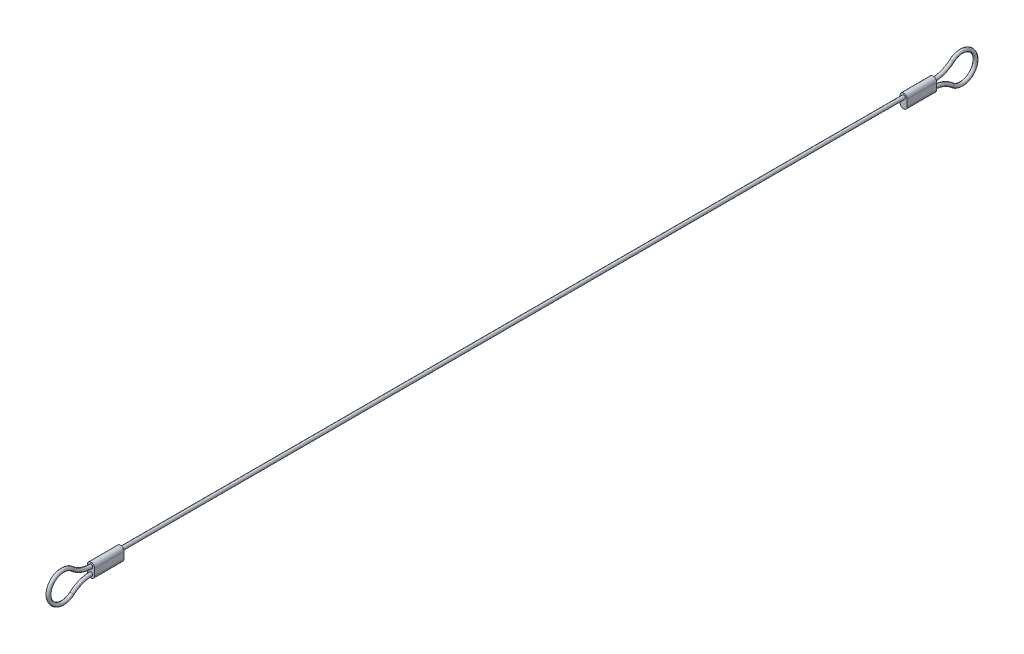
ISO-10303-21;
HEADER;
FILE_DESCRIPTION(('STEP AP214'),'2;1');
FILE_NAME('part.step','',(''),(''),'','','');
FILE_SCHEMA(('AUTOMOTIVE_DESIGN { 1 0 10303 214 1 1 1 1 }'));
ENDSEC;
DATA;
#1=APPLICATION_CONTEXT('core data for automotive mechanical design processes');
#2=APPLICATION_PROTOCOL_DEFINITION('international standard','automotive_design',2000,#1);
#3=PRODUCT_CONTEXT('',#1,'mechanical');
#4=PRODUCT('Part','Part','',(#3));
#5=PRODUCT_RELATED_PRODUCT_CATEGORY('part','',(#4));
#6=PRODUCT_DEFINITION_FORMATION('','',#4);
#7=PRODUCT_DEFINITION_CONTEXT('part definition',#1,'design');
#8=PRODUCT_DEFINITION('design','',#6,#7);
#9=PRODUCT_DEFINITION_SHAPE('','',#8);
#10=(LENGTH_UNIT() NAMED_UNIT(*) SI_UNIT(.MILLI.,.METRE.));
#11=(NAMED_UNIT(*) PLANE_ANGLE_UNIT() SI_UNIT($,.RADIAN.));
#12=(NAMED_UNIT(*) SI_UNIT($,.STERADIAN.) SOLID_ANGLE_UNIT());
#13=UNCERTAINTY_MEASURE_WITH_UNIT(LENGTH_MEASURE(1.E-05),#10,'distance_accuracy_value','');
#14=(GEOMETRIC_REPRESENTATION_CONTEXT(3) GLOBAL_UNCERTAINTY_ASSIGNED_CONTEXT((#13)) GLOBAL_UNIT_ASSIGNED_CONTEXT((#10,
#11,#12)) REPRESENTATION_CONTEXT('',''));
#15=CARTESIAN_POINT('',(0.,0.,0.));
#16=DIRECTION('',(0.,0.,1.));
#17=DIRECTION('',(1.,0.,0.));
#18=AXIS2_PLACEMENT_3D('',#15,#16,#17);
#19=CARTESIAN_POINT('',(0.,0.,-142.8));
#20=DIRECTION('',(0.,0.,1.));
#21=DIRECTION('',(1.,0.,0.));
#22=AXIS2_PLACEMENT_3D('',#19,#20,#21);
#23=CYLINDRICAL_SURFACE('',#22,0.595);
#24=CARTESIAN_POINT('',(0.,0.,-132.8));
#25=DIRECTION('',(0.,0.,1.));
#26=DIRECTION('',(0.,-1.,0.));
#27=AXIS2_PLACEMENT_3D('',#24,#25,#26);
#28=CIRCLE('',#27,0.595);
#29=CARTESIAN_POINT('',(0.,-0.595,-132.8));
#30=VERTEX_POINT('',#29);
#31=EDGE_CURVE('E11',#30,#30,#28,.F.);
#32=ORIENTED_EDGE('',*,*,#31,.F.);
#33=EDGE_LOOP('',(#32));
#34=FACE_BOUND('',#33,.T.);
#35=CARTESIAN_POINT('',(0.,0.,132.8));
#36=DIRECTION('',(0.,0.,-1.));
#37=DIRECTION('',(0.,1.,0.));
#38=AXIS2_PLACEMENT_3D('',#35,#36,#37);
#39=CIRCLE('',#38,0.595);
#40=CARTESIAN_POINT('',(0.,0.595,132.8));
#41=VERTEX_POINT('',#40);
#42=EDGE_CURVE('E51',#41,#41,#39,.F.);
#43=ORIENTED_EDGE('',*,*,#42,.F.);
#44=EDGE_LOOP('',(#43));
#45=FACE_BOUND('',#44,.T.);
#46=ADVANCED_FACE('F41',(#34,#45),#23,.T.);
#47=CARTESIAN_POINT('',(0.,2.0643209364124E-13,142.8));
#48=DIRECTION('',(0.,0.,-1.));
#49=DIRECTION('',(0.,1.,0.));
#50=AXIS2_PLACEMENT_3D('',#47,#48,#49);
#51=PLANE('',#50);
#52=CARTESIAN_POINT('',(0.,2.0643209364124E-13,142.8));
#53=DIRECTION('',(0.,0.,-1.));
#54=DIRECTION('',(0.,1.,0.));
#55=AXIS2_PLACEMENT_3D('',#52,#53,#54);
#56=CIRCLE('',#55,1.2);
#57=CARTESIAN_POINT('',(-1.2,2.06579051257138E-13,142.8));
#58=VERTEX_POINT('',#57);
#59=CARTESIAN_POINT('',(1.2,2.06285136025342E-13,142.8));
#60=VERTEX_POINT('',#59);
#61=EDGE_CURVE('E186',#58,#60,#56,.T.);
#62=ORIENTED_EDGE('',*,*,#61,.F.);
#63=DIRECTION('',(0.,1.,0.));
#64=VECTOR('',#63,1.);
#65=CARTESIAN_POINT('',(-1.2,2.06579051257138E-13,142.8));
#66=LINE('',#65,#64);
#67=CARTESIAN_POINT('',(-1.2,-2.26625258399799,142.8));
#68=VERTEX_POINT('',#67);
#69=EDGE_CURVE('E83',#68,#58,#66,.T.);
#70=ORIENTED_EDGE('',*,*,#69,.F.);
#71=CARTESIAN_POINT('',(0.,-2.26625258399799,142.8));
#72=DIRECTION('',(0.,0.,-1.));
#73=DIRECTION('',(0.,1.,0.));
#74=AXIS2_PLACEMENT_3D('',#71,#72,#73);
#75=CIRCLE('',#74,1.2);
#76=CARTESIAN_POINT('',(1.2,-2.26625258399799,142.8));
#77=VERTEX_POINT('',#76);
#78=EDGE_CURVE('E77',#77,#68,#75,.T.);
#79=ORIENTED_EDGE('',*,*,#78,.F.);
#80=DIRECTION('',(0.,-1.,0.));
#81=VECTOR('',#80,1.);
#82=CARTESIAN_POINT('',(1.2,2.06285136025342E-13,142.8));
#83=LINE('',#82,#81);
#84=EDGE_CURVE('E190',#60,#77,#83,.T.);
#85=ORIENTED_EDGE('',*,*,#84,.F.);
#86=EDGE_LOOP('',(#62,#70,#79,#85));
#87=FACE_BOUND('',#86,.T.);
#88=CARTESIAN_POINT('',(0.,0.,142.8));
#89=DIRECTION('',(0.,0.,-1.));
#90=DIRECTION('',(0.,1.,0.));
#91=AXIS2_PLACEMENT_3D('',#88,#89,#90);
#92=CIRCLE('',#91,0.595);
#93=CARTESIAN_POINT('',(0.,-0.594999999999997,142.8));
#94=VERTEX_POINT('',#93);
#95=EDGE_CURVE('E207',#94,#94,#92,.F.);
#96=ORIENTED_EDGE('',*,*,#95,.F.);
#97=EDGE_LOOP('',(#96));
#98=FACE_BOUND('',#97,.T.);
#99=CARTESIAN_POINT('',(0.,-2.26625258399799,142.8));
#100=DIRECTION('',(0.,0.,-1.));
#101=DIRECTION('',(1.,0.,0.));
#102=AXIS2_PLACEMENT_3D('',#99,#100,#101);
#103=CIRCLE('',#102,0.595);
#104=CARTESIAN_POINT('',(0.,-1.67125258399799,142.8));
#105=VERTEX_POINT('',#104);
#106=EDGE_CURVE('E233',#105,#105,#103,.T.);
#107=ORIENTED_EDGE('',*,*,#106,.T.);
#108=EDGE_LOOP('',(#107));
#109=FACE_BOUND('',#108,.T.);
#110=ADVANCED_FACE('F243',(#87,#98,#109),#51,.F.);
#111=CARTESIAN_POINT('',(0.,1.91976064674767E-13,132.8));
#112=DIRECTION('',(0.,0.,1.));
#113=DIRECTION('',(0.,-1.,0.));
#114=AXIS2_PLACEMENT_3D('',#111,#112,#113);
#115=CYLINDRICAL_SURFACE('',#114,1.2);
#116=ORIENTED_EDGE('',*,*,#61,.T.);
#117=DIRECTION('',(0.,0.,1.));
#118=VECTOR('',#117,1.);
#119=CARTESIAN_POINT('',(1.2,1.91829107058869E-13,132.8));
#120=LINE('',#119,#118);
#121=CARTESIAN_POINT('',(1.2,1.91829107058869E-13,132.8));
#122=VERTEX_POINT('',#121);
#123=EDGE_CURVE('E204',#122,#60,#120,.T.);
#124=ORIENTED_EDGE('',*,*,#123,.F.);
#125=CARTESIAN_POINT('',(0.,1.91976064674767E-13,132.8));
#126=DIRECTION('',(0.,0.,-1.));
#127=DIRECTION('',(0.,1.,0.));
#128=AXIS2_PLACEMENT_3D('',#125,#126,#127);
#129=CIRCLE('',#128,1.2);
#130=CARTESIAN_POINT('',(-1.2,1.92123022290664E-13,132.8));
#131=VERTEX_POINT('',#130);
#132=EDGE_CURVE('E175',#131,#122,#129,.T.);
#133=ORIENTED_EDGE('',*,*,#132,.F.);
#134=DIRECTION('',(0.,0.,1.));
#135=VECTOR('',#134,1.);
#136=CARTESIAN_POINT('',(-1.2,1.92123022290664E-13,132.8));
#137=LINE('',#136,#135);
#138=EDGE_CURVE('E185',#131,#58,#137,.T.);
#139=ORIENTED_EDGE('',*,*,#138,.T.);
#140=EDGE_LOOP('',(#116,#124,#133,#139));
#141=FACE_BOUND('',#140,.T.);
#142=ADVANCED_FACE('F249',(#141),#115,.T.);
#143=CARTESIAN_POINT('',(1.2,1.91829107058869E-13,132.8));
#144=DIRECTION('',(-1.,0.,0.));
#145=DIRECTION('',(0.,0.,1.));
#146=AXIS2_PLACEMENT_3D('',#143,#144,#145);
#147=PLANE('',#146);
#148=ORIENTED_EDGE('',*,*,#84,.T.);
#149=DIRECTION('',(0.,0.,1.));
#150=VECTOR('',#149,1.);
#151=CARTESIAN_POINT('',(1.2,-2.266252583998,132.8));
#152=LINE('',#151,#150);
#153=CARTESIAN_POINT('',(1.2,-2.266252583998,132.8));
#154=VERTEX_POINT('',#153);
#155=EDGE_CURVE('E201',#154,#77,#152,.T.);
#156=ORIENTED_EDGE('',*,*,#155,.F.);
#157=DIRECTION('',(0.,-1.,0.));
#158=VECTOR('',#157,1.);
#159=CARTESIAN_POINT('',(1.2,1.91829107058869E-13,132.8));
#160=LINE('',#159,#158);
#161=EDGE_CURVE('E91',#122,#154,#160,.T.);
#162=ORIENTED_EDGE('',*,*,#161,.F.);
#163=ORIENTED_EDGE('',*,*,#123,.T.);
#164=EDGE_LOOP('',(#148,#156,#162,#163));
#165=FACE_BOUND('',#164,.T.);
#166=ADVANCED_FACE('F291',(#165),#147,.F.);
#167=CARTESIAN_POINT('',(0.,-2.266252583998,132.8));
#168=DIRECTION('',(0.,0.,1.));
#169=DIRECTION('',(0.,-1.,0.));
#170=AXIS2_PLACEMENT_3D('',#167,#168,#169);
#171=CYLINDRICAL_SURFACE('',#170,1.2);
#172=ORIENTED_EDGE('',*,*,#78,.T.);
#173=DIRECTION('',(0.,0.,1.));
#174=VECTOR('',#173,1.);
#175=CARTESIAN_POINT('',(-1.2,-2.266252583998,132.8));
#176=LINE('',#175,#174);
#177=CARTESIAN_POINT('',(-1.2,-2.266252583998,132.8));
#178=VERTEX_POINT('',#177);
#179=EDGE_CURVE('E198',#178,#68,#176,.T.);
#180=ORIENTED_EDGE('',*,*,#179,.F.);
#181=CARTESIAN_POINT('',(0.,-2.266252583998,132.8));
#182=DIRECTION('',(0.,0.,-1.));
#183=DIRECTION('',(0.,1.,0.));
#184=AXIS2_PLACEMENT_3D('',#181,#182,#183);
#185=CIRCLE('',#184,1.2);
#186=EDGE_CURVE('E180',#154,#178,#185,.T.);
#187=ORIENTED_EDGE('',*,*,#186,.F.);
#188=ORIENTED_EDGE('',*,*,#155,.T.);
#189=EDGE_LOOP('',(#172,#180,#187,#188));
#190=FACE_BOUND('',#189,.T.);
#191=ADVANCED_FACE('F284',(#190),#171,.T.);
#192=CARTESIAN_POINT('',(-1.2,1.92123022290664E-13,132.8));
#193=DIRECTION('',(1.,0.,0.));
#194=DIRECTION('',(0.,1.,0.));
#195=AXIS2_PLACEMENT_3D('',#192,#193,#194);
#196=PLANE('',#195);
#197=ORIENTED_EDGE('',*,*,#69,.T.);
#198=ORIENTED_EDGE('',*,*,#138,.F.);
#199=DIRECTION('',(0.,1.,0.));
#200=VECTOR('',#199,1.);
#201=CARTESIAN_POINT('',(-1.2,1.92123022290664E-13,132.8));
#202=LINE('',#201,#200);
#203=EDGE_CURVE('E59',#178,#131,#202,.T.);
#204=ORIENTED_EDGE('',*,*,#203,.F.);
#205=ORIENTED_EDGE('',*,*,#179,.T.);
#206=EDGE_LOOP('',(#197,#198,#204,#205));
#207=FACE_BOUND('',#206,.T.);
#208=ADVANCED_FACE('F279',(#207),#196,.F.);
#209=CARTESIAN_POINT('',(0.,1.91976064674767E-13,132.8));
#210=DIRECTION('',(0.,0.,-1.));
#211=DIRECTION('',(0.,1.,0.));
#212=AXIS2_PLACEMENT_3D('',#209,#210,#211);
#213=PLANE('',#212);
#214=ORIENTED_EDGE('',*,*,#42,.T.);
#215=EDGE_LOOP('',(#214));
#216=FACE_BOUND('',#215,.T.);
#217=ORIENTED_EDGE('',*,*,#132,.T.);
#218=ORIENTED_EDGE('',*,*,#161,.T.);
#219=ORIENTED_EDGE('',*,*,#186,.T.);
#220=ORIENTED_EDGE('',*,*,#203,.T.);
#221=EDGE_LOOP('',(#217,#218,#219,#220));
#222=FACE_BOUND('',#221,.T.);
#223=ADVANCED_FACE('F240',(#216,#222),#213,.T.);
#224=CARTESIAN_POINT('',(0.,-11.866252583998,142.8));
#225=DIRECTION('',(-1.,0.,0.));
#226=DIRECTION('',(0.,0.,1.));
#227=AXIS2_PLACEMENT_3D('',#224,#225,#226);
#228=TOROIDAL_SURFACE('',#227,9.59999999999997,0.595);
#229=CARTESIAN_POINT('',(0.,-4.71083505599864,149.2));
#230=DIRECTION('',(0.,0.666666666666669,-0.745355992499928));
#231=DIRECTION('',(1.,0.,0.));
#232=AXIS2_PLACEMENT_3D('',#229,#230,#231);
#233=CIRCLE('',#232,0.595);
#234=CARTESIAN_POINT('',(0.,-4.26734824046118,149.596666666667));
#235=VERTEX_POINT('',#234);
#236=EDGE_CURVE('E229',#235,#235,#233,.T.);
#237=CARTESIAN_POINT('',(0.,-11.866252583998,142.8));
#238=DIRECTION('',(-1.,0.,0.));
#239=DIRECTION('',(0.,0.,1.));
#240=AXIS2_PLACEMENT_3D('',#237,#238,#239);
#241=CIRCLE('',#240,10.195);
#242=EDGE_CURVE('',#235,#105,#241,.T.);
#243=ORIENTED_EDGE('',*,*,#236,.T.);
#244=ORIENTED_EDGE('',*,*,#106,.F.);
#245=ORIENTED_EDGE('',*,*,#242,.T.);
#246=ORIENTED_EDGE('',*,*,#242,.F.);
#247=EDGE_LOOP('',(#243,#245,#244,#246));
#248=FACE_BOUND('',#247,.T.);
#249=ADVANCED_FACE('F43',(#248),#228,.T.);
#250=CARTESIAN_POINT('',(0.,-1.13312629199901,152.4));
#251=DIRECTION('',(1.,0.,0.));
#252=DIRECTION('',(0.,0.,-1.));
#253=AXIS2_PLACEMENT_3D('',#250,#251,#252);
#254=TOROIDAL_SURFACE('',#253,4.80000000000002,0.595);
#255=ORIENTED_EDGE('',*,*,#236,.F.);
#256=EDGE_LOOP('',(#255));
#257=FACE_BOUND('',#256,.T.);
#258=CARTESIAN_POINT('',(0.,2.4445824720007,149.2));
#259=DIRECTION('',(0.,0.666666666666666,0.745355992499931));
#260=DIRECTION('',(1.,0.,0.));
#261=AXIS2_PLACEMENT_3D('',#258,#259,#260);
#262=CIRCLE('',#261,0.595);
#263=CARTESIAN_POINT('',(0.,2.00109565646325,149.596666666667));
#264=VERTEX_POINT('',#263);
#265=EDGE_CURVE('E225',#264,#264,#262,.T.);
#266=ORIENTED_EDGE('',*,*,#265,.T.);
#267=EDGE_LOOP('',(#266));
#268=FACE_BOUND('',#267,.T.);
#269=ADVANCED_FACE('F259',(#257,#268),#254,.T.);
#270=CARTESIAN_POINT('',(0.,9.59999999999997,142.8));
#271=DIRECTION('',(-1.,0.,0.));
#272=DIRECTION('',(0.,0.,1.));
#273=AXIS2_PLACEMENT_3D('',#270,#271,#272);
#274=TOROIDAL_SURFACE('',#273,9.59999999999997,0.595);
#275=CARTESIAN_POINT('',(0.,9.59999999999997,142.8));
#276=DIRECTION('',(-1.,0.,0.));
#277=DIRECTION('',(0.,0.,1.));
#278=AXIS2_PLACEMENT_3D('',#275,#276,#277);
#279=CIRCLE('',#278,10.195);
#280=EDGE_CURVE('',#94,#264,#279,.T.);
#281=ORIENTED_EDGE('',*,*,#95,.T.);
#282=ORIENTED_EDGE('',*,*,#265,.F.);
#283=ORIENTED_EDGE('',*,*,#280,.T.);
#284=ORIENTED_EDGE('',*,*,#280,.F.);
#285=EDGE_LOOP('',(#281,#283,#282,#284));
#286=FACE_BOUND('',#285,.T.);
#287=ADVANCED_FACE('F257',(#286),#274,.T.);
#288=CARTESIAN_POINT('',(0.,1.91976064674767E-13,-132.8));
#289=DIRECTION('',(0.,0.,-1.));
#290=DIRECTION('',(0.,1.,0.));
#291=AXIS2_PLACEMENT_3D('',#288,#289,#290);
#292=CYLINDRICAL_SURFACE('',#291,1.2);
#293=CARTESIAN_POINT('',(0.,2.0643209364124E-13,-142.8));
#294=DIRECTION('',(0.,0.,-1.));
#295=DIRECTION('',(0.,1.,0.));
#296=AXIS2_PLACEMENT_3D('',#293,#294,#295);
#297=CIRCLE('',#296,1.2);
#298=CARTESIAN_POINT('',(-1.2,2.06579051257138E-13,-142.8));
#299=VERTEX_POINT('',#298);
#300=CARTESIAN_POINT('',(1.2,2.06285136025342E-13,-142.8));
#301=VERTEX_POINT('',#300);
#302=EDGE_CURVE('E124',#299,#301,#297,.T.);
#303=ORIENTED_EDGE('',*,*,#302,.F.);
#304=DIRECTION('',(0.,0.,-1.));
#305=VECTOR('',#304,1.);
#306=CARTESIAN_POINT('',(-1.2,1.92123022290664E-13,-132.8));
#307=LINE('',#306,#305);
#308=CARTESIAN_POINT('',(-1.2,1.92123022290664E-13,-132.8));
#309=VERTEX_POINT('',#308);
#310=EDGE_CURVE('E118',#309,#299,#307,.T.);
#311=ORIENTED_EDGE('',*,*,#310,.F.);
#312=CARTESIAN_POINT('',(0.,1.91976064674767E-13,-132.8));
#313=DIRECTION('',(0.,0.,-1.));
#314=DIRECTION('',(0.,1.,0.));
#315=AXIS2_PLACEMENT_3D('',#312,#313,#314);
#316=CIRCLE('',#315,1.2);
#317=CARTESIAN_POINT('',(1.2,1.91829107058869E-13,-132.8));
#318=VERTEX_POINT('',#317);
#319=EDGE_CURVE('E121',#309,#318,#316,.T.);
#320=ORIENTED_EDGE('',*,*,#319,.T.);
#321=DIRECTION('',(0.,0.,-1.));
#322=VECTOR('',#321,1.);
#323=CARTESIAN_POINT('',(1.2,1.91829107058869E-13,-132.8));
#324=LINE('',#323,#322);
#325=EDGE_CURVE('E155',#318,#301,#324,.T.);
#326=ORIENTED_EDGE('',*,*,#325,.T.);
#327=EDGE_LOOP('',(#303,#311,#320,#326));
#328=FACE_BOUND('',#327,.T.);
#329=ADVANCED_FACE('F120',(#328),#292,.T.);
#330=CARTESIAN_POINT('',(-1.2,1.92123022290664E-13,-132.8));
#331=DIRECTION('',(-1.,0.,0.));
#332=DIRECTION('',(0.,-1.,0.));
#333=AXIS2_PLACEMENT_3D('',#330,#331,#332);
#334=PLANE('',#333);
#335=DIRECTION('',(0.,1.,0.));
#336=VECTOR('',#335,1.);
#337=CARTESIAN_POINT('',(-1.2,2.06579051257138E-13,-142.8));
#338=LINE('',#337,#336);
#339=CARTESIAN_POINT('',(-1.2,-2.26625258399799,-142.8));
#340=VERTEX_POINT('',#339);
#341=EDGE_CURVE('E158',#340,#299,#338,.T.);
#342=ORIENTED_EDGE('',*,*,#341,.F.);
#343=DIRECTION('',(0.,0.,-1.));
#344=VECTOR('',#343,1.);
#345=CARTESIAN_POINT('',(-1.2,-2.266252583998,-132.8));
#346=LINE('',#345,#344);
#347=CARTESIAN_POINT('',(-1.2,-2.266252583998,-132.8));
#348=VERTEX_POINT('',#347);
#349=EDGE_CURVE('E131',#348,#340,#346,.T.);
#350=ORIENTED_EDGE('',*,*,#349,.F.);
#351=DIRECTION('',(0.,1.,0.));
#352=VECTOR('',#351,1.);
#353=CARTESIAN_POINT('',(-1.2,1.92123022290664E-13,-132.8));
#354=LINE('',#353,#352);
#355=EDGE_CURVE('E137',#348,#309,#354,.T.);
#356=ORIENTED_EDGE('',*,*,#355,.T.);
#357=ORIENTED_EDGE('',*,*,#310,.T.);
#358=EDGE_LOOP('',(#342,#350,#356,#357));
#359=FACE_BOUND('',#358,.T.);
#360=ADVANCED_FACE('F144',(#359),#334,.T.);
#361=CARTESIAN_POINT('',(0.,-2.266252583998,-132.8));
#362=DIRECTION('',(0.,0.,-1.));
#363=DIRECTION('',(0.,1.,0.));
#364=AXIS2_PLACEMENT_3D('',#361,#362,#363);
#365=CYLINDRICAL_SURFACE('',#364,1.2);
#366=CARTESIAN_POINT('',(0.,-2.26625258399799,-142.8));
#367=DIRECTION('',(0.,0.,-1.));
#368=DIRECTION('',(0.,1.,0.));
#369=AXIS2_PLACEMENT_3D('',#366,#367,#368);
#370=CIRCLE('',#369,1.2);
#371=CARTESIAN_POINT('',(1.2,-2.26625258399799,-142.8));
#372=VERTEX_POINT('',#371);
#373=EDGE_CURVE('E161',#372,#340,#370,.T.);
#374=ORIENTED_EDGE('',*,*,#373,.F.);
#375=DIRECTION('',(0.,0.,-1.));
#376=VECTOR('',#375,1.);
#377=CARTESIAN_POINT('',(1.2,-2.266252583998,-132.8));
#378=LINE('',#377,#376);
#379=CARTESIAN_POINT('',(1.2,-2.266252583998,-132.8));
#380=VERTEX_POINT('',#379);
#381=EDGE_CURVE('E170',#380,#372,#378,.T.);
#382=ORIENTED_EDGE('',*,*,#381,.F.);
#383=CARTESIAN_POINT('',(0.,-2.266252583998,-132.8));
#384=DIRECTION('',(0.,0.,-1.));
#385=DIRECTION('',(0.,1.,0.));
#386=AXIS2_PLACEMENT_3D('',#383,#384,#385);
#387=CIRCLE('',#386,1.2);
#388=EDGE_CURVE('E146',#380,#348,#387,.T.);
#389=ORIENTED_EDGE('',*,*,#388,.T.);
#390=ORIENTED_EDGE('',*,*,#349,.T.);
#391=EDGE_LOOP('',(#374,#382,#389,#390));
#392=FACE_BOUND('',#391,.T.);
#393=ADVANCED_FACE('F324',(#392),#365,.T.);
#394=CARTESIAN_POINT('',(1.2,1.91829107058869E-13,-132.8));
#395=DIRECTION('',(1.,0.,0.));
#396=DIRECTION('',(0.,0.,-1.));
#397=AXIS2_PLACEMENT_3D('',#394,#395,#396);
#398=PLANE('',#397);
#399=DIRECTION('',(0.,-1.,0.));
#400=VECTOR('',#399,1.);
#401=CARTESIAN_POINT('',(1.2,2.06285136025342E-13,-142.8));
#402=LINE('',#401,#400);
#403=EDGE_CURVE('E142',#301,#372,#402,.T.);
#404=ORIENTED_EDGE('',*,*,#403,.F.);
#405=ORIENTED_EDGE('',*,*,#325,.F.);
#406=DIRECTION('',(0.,-1.,0.));
#407=VECTOR('',#406,1.);
#408=CARTESIAN_POINT('',(1.2,1.91829107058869E-13,-132.8));
#409=LINE('',#408,#407);
#410=EDGE_CURVE('E140',#318,#380,#409,.T.);
#411=ORIENTED_EDGE('',*,*,#410,.T.);
#412=ORIENTED_EDGE('',*,*,#381,.T.);
#413=EDGE_LOOP('',(#404,#405,#411,#412));
#414=FACE_BOUND('',#413,.T.);
#415=ADVANCED_FACE('F321',(#414),#398,.T.);
#416=CARTESIAN_POINT('',(0.,1.91976064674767E-13,-132.8));
#417=DIRECTION('',(0.,0.,1.));
#418=DIRECTION('',(0.,1.,0.));
#419=AXIS2_PLACEMENT_3D('',#416,#417,#418);
#420=PLANE('',#419);
#421=ORIENTED_EDGE('',*,*,#31,.T.);
#422=EDGE_LOOP('',(#421));
#423=FACE_BOUND('',#422,.T.);
#424=ORIENTED_EDGE('',*,*,#319,.F.);
#425=ORIENTED_EDGE('',*,*,#355,.F.);
#426=ORIENTED_EDGE('',*,*,#388,.F.);
#427=ORIENTED_EDGE('',*,*,#410,.F.);
#428=EDGE_LOOP('',(#424,#425,#426,#427));
#429=FACE_BOUND('',#428,.T.);
#430=ADVANCED_FACE('F135',(#423,#429),#420,.T.);
#431=CARTESIAN_POINT('',(0.,2.0643209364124E-13,-142.8));
#432=DIRECTION('',(0.,0.,1.));
#433=DIRECTION('',(0.,1.,0.));
#434=AXIS2_PLACEMENT_3D('',#431,#432,#433);
#435=PLANE('',#434);
#436=CARTESIAN_POINT('',(0.,-2.26625258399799,-142.8));
#437=DIRECTION('',(0.,0.,-1.));
#438=DIRECTION('',(1.,0.,0.));
#439=AXIS2_PLACEMENT_3D('',#436,#437,#438);
#440=CIRCLE('',#439,0.595);
#441=CARTESIAN_POINT('',(0.,-1.67125258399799,-142.8));
#442=VERTEX_POINT('',#441);
#443=EDGE_CURVE('E130',#442,#442,#440,.T.);
#444=ORIENTED_EDGE('',*,*,#443,.F.);
#445=EDGE_LOOP('',(#444));
#446=FACE_BOUND('',#445,.T.);
#447=CARTESIAN_POINT('',(0.,0.,-142.8));
#448=DIRECTION('',(0.,0.,1.));
#449=DIRECTION('',(1.,0.,0.));
#450=AXIS2_PLACEMENT_3D('',#447,#448,#449);
#451=CIRCLE('',#450,0.595);
#452=CARTESIAN_POINT('',(0.,-0.594999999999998,-142.8));
#453=VERTEX_POINT('',#452);
#454=EDGE_CURVE('E221',#453,#453,#451,.T.);
#455=ORIENTED_EDGE('',*,*,#454,.T.);
#456=EDGE_LOOP('',(#455));
#457=FACE_BOUND('',#456,.T.);
#458=ORIENTED_EDGE('',*,*,#302,.T.);
#459=ORIENTED_EDGE('',*,*,#403,.T.);
#460=ORIENTED_EDGE('',*,*,#373,.T.);
#461=ORIENTED_EDGE('',*,*,#341,.T.);
#462=EDGE_LOOP('',(#458,#459,#460,#461));
#463=FACE_BOUND('',#462,.T.);
#464=ADVANCED_FACE('F300',(#446,#457,#463),#435,.F.);
#465=CARTESIAN_POINT('',(0.,-11.866252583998,-142.8));
#466=DIRECTION('',(-1.,0.,0.));
#467=DIRECTION('',(0.,0.,1.));
#468=AXIS2_PLACEMENT_3D('',#465,#466,#467);
#469=TOROIDAL_SURFACE('',#468,9.59999999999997,0.595);
#470=CARTESIAN_POINT('',(0.,-4.71083505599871,-149.2));
#471=DIRECTION('',(0.,-0.666666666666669,-0.745355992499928));
#472=DIRECTION('',(1.,0.,0.));
#473=AXIS2_PLACEMENT_3D('',#470,#471,#472);
#474=CIRCLE('',#473,0.595);
#475=CARTESIAN_POINT('',(0.,-4.26734824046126,-149.596666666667));
#476=VERTEX_POINT('',#475);
#477=EDGE_CURVE('E211',#476,#476,#474,.T.);
#478=CARTESIAN_POINT('',(0.,-11.866252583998,-142.8));
#479=DIRECTION('',(-1.,0.,0.));
#480=DIRECTION('',(0.,0.,1.));
#481=AXIS2_PLACEMENT_3D('',#478,#479,#480);
#482=CIRCLE('',#481,10.195);
#483=EDGE_CURVE('',#442,#476,#482,.T.);
#484=ORIENTED_EDGE('',*,*,#443,.T.);
#485=ORIENTED_EDGE('',*,*,#477,.F.);
#486=ORIENTED_EDGE('',*,*,#483,.T.);
#487=ORIENTED_EDGE('',*,*,#483,.F.);
#488=EDGE_LOOP('',(#484,#486,#485,#487));
#489=FACE_BOUND('',#488,.T.);
#490=ADVANCED_FACE('F297',(#489),#469,.T.);
#491=CARTESIAN_POINT('',(0.,-1.13312629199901,-152.4));
#492=DIRECTION('',(1.,0.,0.));
#493=DIRECTION('',(0.,0.,-1.));
#494=AXIS2_PLACEMENT_3D('',#491,#492,#493);
#495=TOROIDAL_SURFACE('',#494,4.80000000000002,0.595);
#496=CARTESIAN_POINT('',(0.,2.44458247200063,-149.2));
#497=DIRECTION('',(0.,-0.666666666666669,0.745355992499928));
#498=DIRECTION('',(1.,0.,0.));
#499=AXIS2_PLACEMENT_3D('',#496,#497,#498);
#500=CIRCLE('',#499,0.595);
#501=CARTESIAN_POINT('',(0.,2.00109565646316,-149.596666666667));
#502=VERTEX_POINT('',#501);
#503=EDGE_CURVE('E218',#502,#502,#500,.T.);
#504=ORIENTED_EDGE('',*,*,#503,.F.);
#505=EDGE_LOOP('',(#504));
#506=FACE_BOUND('',#505,.T.);
#507=ORIENTED_EDGE('',*,*,#477,.T.);
#508=EDGE_LOOP('',(#507));
#509=FACE_BOUND('',#508,.T.);
#510=ADVANCED_FACE('F299',(#506,#509),#495,.T.);
#511=CARTESIAN_POINT('',(0.,9.59999999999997,-142.8));
#512=DIRECTION('',(-1.,0.,0.));
#513=DIRECTION('',(0.,0.,1.));
#514=AXIS2_PLACEMENT_3D('',#511,#512,#513);
#515=TOROIDAL_SURFACE('',#514,9.59999999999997,0.595);
#516=CARTESIAN_POINT('',(0.,9.59999999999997,-142.8));
#517=DIRECTION('',(-1.,0.,0.));
#518=DIRECTION('',(0.,0.,1.));
#519=AXIS2_PLACEMENT_3D('',#516,#517,#518);
#520=CIRCLE('',#519,10.195);
#521=EDGE_CURVE('',#502,#453,#520,.T.);
#522=ORIENTED_EDGE('',*,*,#503,.T.);
#523=ORIENTED_EDGE('',*,*,#454,.F.);
#524=ORIENTED_EDGE('',*,*,#521,.T.);
#525=ORIENTED_EDGE('',*,*,#521,.F.);
#526=EDGE_LOOP('',(#522,#524,#523,#525));
#527=FACE_BOUND('',#526,.T.);
#528=ADVANCED_FACE('F255',(#527),#515,.T.);
#529=CLOSED_SHELL('',(#46,#110,#142,#166,#191,#208,#223,#249,#269,#287,#329,#360,#393,#415,#430,
#464,#490,#510,#528));
#530=MANIFOLD_SOLID_BREP('B2',#529);
#531=ADVANCED_BREP_SHAPE_REPRESENTATION('',(#18,#530),#14);
#532=SHAPE_DEFINITION_REPRESENTATION(#9,#531);
ENDSEC;
END-ISO-10303-21;
